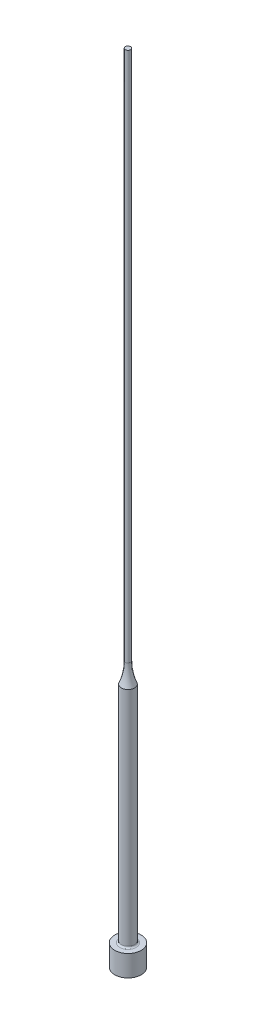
from build123d import *


with BuildPart() as part:
    # Sketch1 → Revolve1 (revolve)
    with BuildSketch(Plane.XY, mode=Mode.PRIVATE) as revolve1_sk:
        with BuildLine():
            Line((0, 0), (2.5, 0))
            Line((2.5, 0), (2.5, 4))
            Line((2.5, 4), (1.55, 4))
            ThreePointArc((1.55, 4), (1.337867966, 4.087867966), (1.25, 4.3))
            Line((1.25, 4.3), (1.25, 46.200328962))
            ThreePointArc((1.25, 46.200328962), (0.689291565, 48.063508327), (0.5, 50))
            Line((0.5, 50), (0.5, 150))
            Line((0.5, 150), (0, 150))
            Line((0, 150), (0, 0))
        make_face()
    revolve(revolve1_sk.sketch.rotate(Axis((0, 150, 0), (0, -1, 0)), 180), axis=Axis((0, 150, 0), (0, -1, 0)))


solid = part.part
